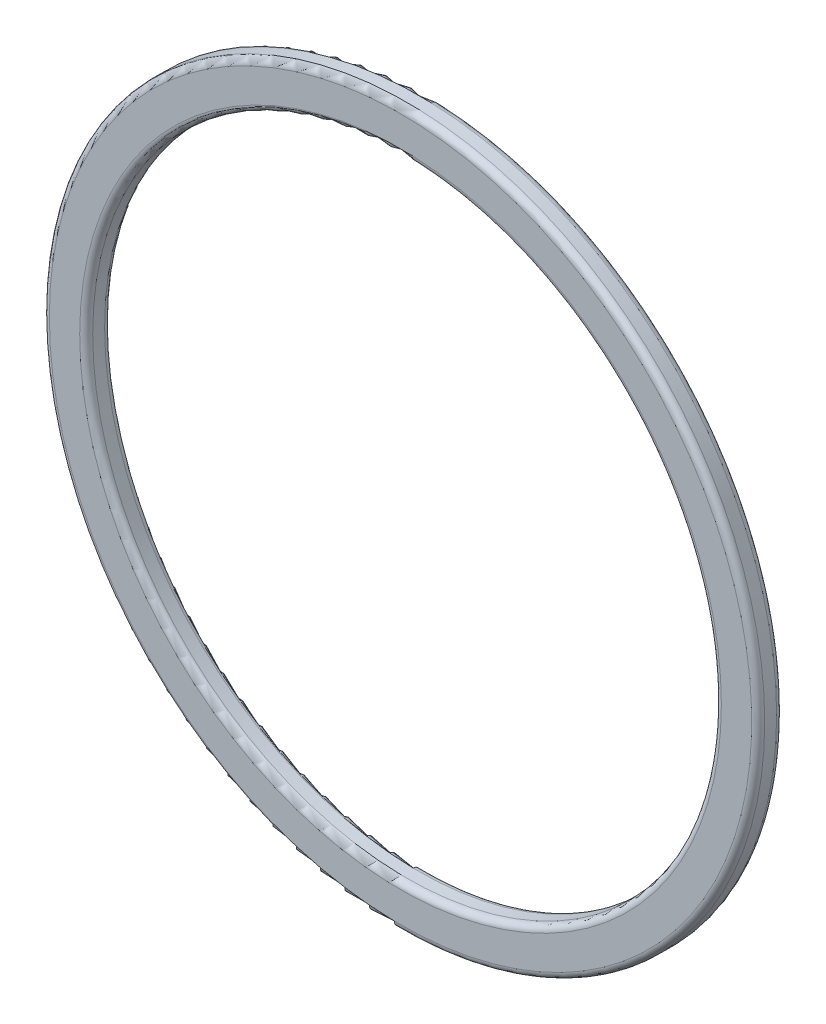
ISO-10303-21;
HEADER;
FILE_DESCRIPTION(('STEP AP214'),'2;1');
FILE_NAME('part.step','',(''),(''),'','','');
FILE_SCHEMA(('AUTOMOTIVE_DESIGN { 1 0 10303 214 1 1 1 1 }'));
ENDSEC;
DATA;
#1=APPLICATION_CONTEXT('core data for automotive mechanical design processes');
#2=APPLICATION_PROTOCOL_DEFINITION('international standard','automotive_design',2000,#1);
#3=PRODUCT_CONTEXT('',#1,'mechanical');
#4=PRODUCT('Part','Part','',(#3));
#5=PRODUCT_RELATED_PRODUCT_CATEGORY('part','',(#4));
#6=PRODUCT_DEFINITION_FORMATION('','',#4);
#7=PRODUCT_DEFINITION_CONTEXT('part definition',#1,'design');
#8=PRODUCT_DEFINITION('design','',#6,#7);
#9=PRODUCT_DEFINITION_SHAPE('','',#8);
#10=(LENGTH_UNIT() NAMED_UNIT(*) SI_UNIT(.MILLI.,.METRE.));
#11=(NAMED_UNIT(*) PLANE_ANGLE_UNIT() SI_UNIT($,.RADIAN.));
#12=(NAMED_UNIT(*) SI_UNIT($,.STERADIAN.) SOLID_ANGLE_UNIT());
#13=UNCERTAINTY_MEASURE_WITH_UNIT(LENGTH_MEASURE(1.E-05),#10,'distance_accuracy_value','');
#14=(GEOMETRIC_REPRESENTATION_CONTEXT(3) GLOBAL_UNCERTAINTY_ASSIGNED_CONTEXT((#13)) GLOBAL_UNIT_ASSIGNED_CONTEXT((#10,
#11,#12)) REPRESENTATION_CONTEXT('',''));
#15=CARTESIAN_POINT('',(0.,0.,0.));
#16=DIRECTION('',(0.,0.,1.));
#17=DIRECTION('',(1.,0.,0.));
#18=AXIS2_PLACEMENT_3D('',#15,#16,#17);
#19=CARTESIAN_POINT('',(0.,0.,-0.413095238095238));
#20=DIRECTION('',(0.,0.,-1.));
#21=DIRECTION('',(-1.,0.,0.));
#22=AXIS2_PLACEMENT_3D('',#19,#20,#21);
#23=TOROIDAL_SURFACE('',#22,29.6,0.6);
#24=CARTESIAN_POINT('',(0.,0.,-1.01309523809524));
#25=DIRECTION('',(0.,0.,-1.));
#26=DIRECTION('',(-1.,0.,0.));
#27=AXIS2_PLACEMENT_3D('',#24,#25,#26);
#28=CIRCLE('',#27,29.6);
#29=CARTESIAN_POINT('',(-29.6,0.,-1.01309523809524));
#30=VERTEX_POINT('',#29);
#31=EDGE_CURVE('E63',#30,#30,#28,.T.);
#32=ORIENTED_EDGE('',*,*,#31,.T.);
#33=EDGE_LOOP('',(#32));
#34=FACE_BOUND('',#33,.T.);
#35=CARTESIAN_POINT('',(0.,0.,-0.413095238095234));
#36=DIRECTION('',(0.,0.,-1.));
#37=DIRECTION('',(-1.,0.,0.));
#38=AXIS2_PLACEMENT_3D('',#35,#36,#37);
#39=CIRCLE('',#38,29.);
#40=CARTESIAN_POINT('',(-29.,0.,-0.413095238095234));
#41=VERTEX_POINT('',#40);
#42=EDGE_CURVE('E10',#41,#41,#39,.T.);
#43=ORIENTED_EDGE('',*,*,#42,.F.);
#44=EDGE_LOOP('',(#43));
#45=FACE_BOUND('',#44,.T.);
#46=ADVANCED_FACE('F35',(#34,#45),#23,.T.);
#47=CARTESIAN_POINT('',(0.,0.,0.));
#48=DIRECTION('',(0.,0.,-1.));
#49=DIRECTION('',(-1.,0.,0.));
#50=AXIS2_PLACEMENT_3D('',#47,#48,#49);
#51=CYLINDRICAL_SURFACE('',#50,29.);
#52=ORIENTED_EDGE('',*,*,#42,.T.);
#53=EDGE_LOOP('',(#52));
#54=FACE_BOUND('',#53,.T.);
#55=CARTESIAN_POINT('',(0.,0.,0.686904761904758));
#56=DIRECTION('',(0.,0.,-1.));
#57=DIRECTION('',(-1.,0.,0.));
#58=AXIS2_PLACEMENT_3D('',#55,#56,#57);
#59=CIRCLE('',#58,29.);
#60=CARTESIAN_POINT('',(-29.,0.,0.686904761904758));
#61=VERTEX_POINT('',#60);
#62=EDGE_CURVE('E41',#61,#61,#59,.T.);
#63=ORIENTED_EDGE('',*,*,#62,.F.);
#64=EDGE_LOOP('',(#63));
#65=FACE_BOUND('',#64,.T.);
#66=ADVANCED_FACE('F81',(#54,#65),#51,.F.);
#67=CARTESIAN_POINT('',(0.,0.,0.686904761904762));
#68=DIRECTION('',(0.,0.,-1.));
#69=DIRECTION('',(-1.,0.,0.));
#70=AXIS2_PLACEMENT_3D('',#67,#68,#69);
#71=TOROIDAL_SURFACE('',#70,29.6,0.6);
#72=ORIENTED_EDGE('',*,*,#62,.T.);
#73=EDGE_LOOP('',(#72));
#74=FACE_BOUND('',#73,.T.);
#75=CARTESIAN_POINT('',(0.,0.,1.28690476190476));
#76=DIRECTION('',(0.,0.,-1.));
#77=DIRECTION('',(-1.,0.,0.));
#78=AXIS2_PLACEMENT_3D('',#75,#76,#77);
#79=CIRCLE('',#78,29.6);
#80=CARTESIAN_POINT('',(-29.6,0.,1.28690476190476));
#81=VERTEX_POINT('',#80);
#82=EDGE_CURVE('E45',#81,#81,#79,.T.);
#83=ORIENTED_EDGE('',*,*,#82,.F.);
#84=EDGE_LOOP('',(#83));
#85=FACE_BOUND('',#84,.T.);
#86=ADVANCED_FACE('F85',(#74,#85),#71,.T.);
#87=CARTESIAN_POINT('',(-32.4,0.,1.28690476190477));
#88=DIRECTION('',(0.,0.,1.));
#89=DIRECTION('',(1.,0.,0.));
#90=AXIS2_PLACEMENT_3D('',#87,#88,#89);
#91=PLANE('',#90);
#92=ORIENTED_EDGE('',*,*,#82,.T.);
#93=EDGE_LOOP('',(#92));
#94=FACE_BOUND('',#93,.T.);
#95=CARTESIAN_POINT('',(0.,0.,1.28690476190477));
#96=DIRECTION('',(0.,0.,-1.));
#97=DIRECTION('',(-1.,0.,0.));
#98=AXIS2_PLACEMENT_3D('',#95,#96,#97);
#99=CIRCLE('',#98,32.4);
#100=CARTESIAN_POINT('',(-32.4,0.,1.28690476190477));
#101=VERTEX_POINT('',#100);
#102=EDGE_CURVE('E49',#101,#101,#99,.T.);
#103=ORIENTED_EDGE('',*,*,#102,.F.);
#104=EDGE_LOOP('',(#103));
#105=FACE_BOUND('',#104,.T.);
#106=ADVANCED_FACE('F89',(#94,#105),#91,.T.);
#107=CARTESIAN_POINT('',(0.,0.,0.686904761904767));
#108=DIRECTION('',(0.,0.,-1.));
#109=DIRECTION('',(-1.,0.,0.));
#110=AXIS2_PLACEMENT_3D('',#107,#108,#109);
#111=TOROIDAL_SURFACE('',#110,32.4,0.600000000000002);
#112=ORIENTED_EDGE('',*,*,#102,.T.);
#113=EDGE_LOOP('',(#112));
#114=FACE_BOUND('',#113,.T.);
#115=CARTESIAN_POINT('',(0.,0.,0.686904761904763));
#116=DIRECTION('',(0.,0.,-1.));
#117=DIRECTION('',(-1.,0.,0.));
#118=AXIS2_PLACEMENT_3D('',#115,#116,#117);
#119=CIRCLE('',#118,33.);
#120=CARTESIAN_POINT('',(-33.,0.,0.686904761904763));
#121=VERTEX_POINT('',#120);
#122=EDGE_CURVE('E54',#121,#121,#119,.T.);
#123=ORIENTED_EDGE('',*,*,#122,.F.);
#124=EDGE_LOOP('',(#123));
#125=FACE_BOUND('',#124,.T.);
#126=ADVANCED_FACE('F95',(#114,#125),#111,.T.);
#127=CARTESIAN_POINT('',(0.,0.,0.));
#128=DIRECTION('',(0.,0.,-1.));
#129=DIRECTION('',(-1.,0.,0.));
#130=AXIS2_PLACEMENT_3D('',#127,#128,#129);
#131=CYLINDRICAL_SURFACE('',#130,33.);
#132=ORIENTED_EDGE('',*,*,#122,.T.);
#133=EDGE_LOOP('',(#132));
#134=FACE_BOUND('',#133,.T.);
#135=CARTESIAN_POINT('',(0.,0.,-0.413095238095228));
#136=DIRECTION('',(0.,0.,-1.));
#137=DIRECTION('',(-1.,0.,0.));
#138=AXIS2_PLACEMENT_3D('',#135,#136,#137);
#139=CIRCLE('',#138,33.);
#140=CARTESIAN_POINT('',(-33.,0.,-0.413095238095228));
#141=VERTEX_POINT('',#140);
#142=EDGE_CURVE('E57',#141,#141,#139,.T.);
#143=ORIENTED_EDGE('',*,*,#142,.F.);
#144=EDGE_LOOP('',(#143));
#145=FACE_BOUND('',#144,.T.);
#146=ADVANCED_FACE('F77',(#134,#145),#131,.T.);
#147=CARTESIAN_POINT('',(0.,0.,-0.413095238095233));
#148=DIRECTION('',(0.,0.,-1.));
#149=DIRECTION('',(-1.,0.,0.));
#150=AXIS2_PLACEMENT_3D('',#147,#148,#149);
#151=TOROIDAL_SURFACE('',#150,32.4,0.600000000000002);
#152=ORIENTED_EDGE('',*,*,#142,.T.);
#153=EDGE_LOOP('',(#152));
#154=FACE_BOUND('',#153,.T.);
#155=CARTESIAN_POINT('',(0.,0.,-1.01309523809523));
#156=DIRECTION('',(0.,0.,-1.));
#157=DIRECTION('',(-1.,0.,0.));
#158=AXIS2_PLACEMENT_3D('',#155,#156,#157);
#159=CIRCLE('',#158,32.4);
#160=CARTESIAN_POINT('',(-32.4,0.,-1.01309523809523));
#161=VERTEX_POINT('',#160);
#162=EDGE_CURVE('E60',#161,#161,#159,.T.);
#163=ORIENTED_EDGE('',*,*,#162,.F.);
#164=EDGE_LOOP('',(#163));
#165=FACE_BOUND('',#164,.T.);
#166=ADVANCED_FACE('F71',(#154,#165),#151,.T.);
#167=CARTESIAN_POINT('',(-32.4,0.,-1.01309523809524));
#168=DIRECTION('',(0.,0.,-1.));
#169=DIRECTION('',(-1.,0.,0.));
#170=AXIS2_PLACEMENT_3D('',#167,#168,#169);
#171=PLANE('',#170);
#172=ORIENTED_EDGE('',*,*,#162,.T.);
#173=EDGE_LOOP('',(#172));
#174=FACE_BOUND('',#173,.T.);
#175=ORIENTED_EDGE('',*,*,#31,.F.);
#176=EDGE_LOOP('',(#175));
#177=FACE_BOUND('',#176,.T.);
#178=ADVANCED_FACE('F69',(#174,#177),#171,.T.);
#179=CLOSED_SHELL('',(#46,#66,#86,#106,#126,#146,#166,#178));
#180=MANIFOLD_SOLID_BREP('B2',#179);
#181=ADVANCED_BREP_SHAPE_REPRESENTATION('',(#18,#180),#14);
#182=SHAPE_DEFINITION_REPRESENTATION(#9,#181);
ENDSEC;
END-ISO-10303-21;
